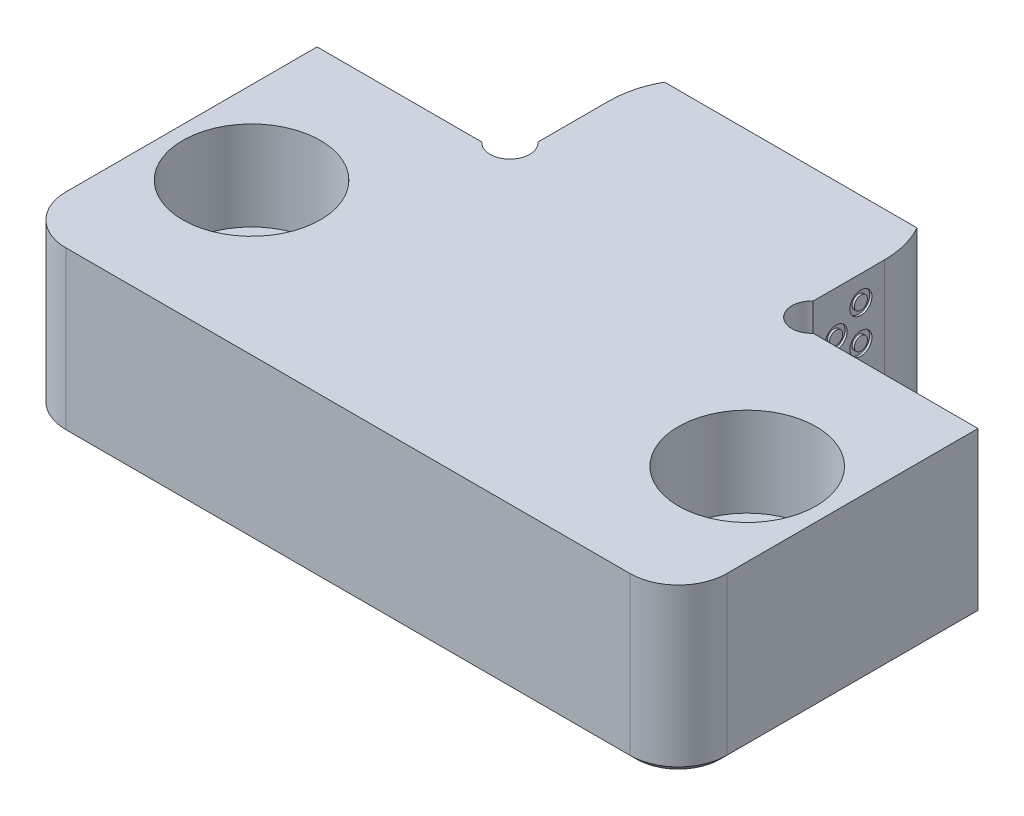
from build123d import *

# Parameters (mm, degrees)
BOSS_EXTRUDE1_DEPTH     = 18.923
SKETCH3_R               = 2.286
CUT_EXTRUDE2_DEPTH      = 55.799433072
CUT_EXTRUDE3_DEPTH      = 86.777665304
FILLET1_R               = 5.588
CHAMFER3_SIZE           = 0.762
F_3_8_CBORE_D           = 10.31748
F_3_8_CBORE_CBORE_D     = 15.875
F_3_8_CBORE_CBORE_DEPTH = 10.287
SKETCH8_R               = 1.27
SKETCH8_R_2             = 0.762
CUT_EXTRUDE4_DEPTH      = 0.254


with BuildPart() as part:
    # Sketch1 → Boss-Extrude1 (new body)
    with BuildSketch(Plane(origin=(0, 0, 0), x_dir=(1, 0, 0), z_dir=(0, 1, 0))):
        with BuildLine():
            Line((-38.1, -34.544), (38.1, -34.544))
            Line((38.1, -34.544), (38.1, 0))
            Line((38.1, 0), (15.87246, 0))
            Line((15.87246, 0), (15.87246, 11.43))
            ThreePointArc((15.87246, 11.43), (15.539429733, 14.053218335), (14.561468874, 16.51))
            Line((14.561468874, 16.51), (-14.561468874, 16.51))
            ThreePointArc((-14.561468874, 16.51), (-15.539429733, 14.053218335), (-15.87246, 11.43))
            Line((-15.87246, 11.43), (-15.87246, 0))
            Line((-15.87246, 0), (-38.1, 0))
            Line((-38.1, 0), (-38.1, -34.544))
        make_face()
    extrude(amount=-BOSS_EXTRUDE1_DEPTH)

    # Sketch3 → Cut-Extrude2 (cut, through all)
    with BuildSketch(Plane(origin=(0, 0, 0), x_dir=(1, 0, 0), z_dir=(0, 1, 0))):
        with Locations((17.39646, 1.524)):
            Circle(SKETCH3_R)
        with Locations((-17.39646, 1.524)):
            Circle(SKETCH3_R)
    extrude(amount=-CUT_EXTRUDE2_DEPTH, mode=Mode.SUBTRACT)

    # Sketch5 → Cut-Extrude3 (cut, through all)
    with BuildSketch(Plane(origin=(38.1, 0, 0), x_dir=(0, 0, -1), z_dir=(1, 0, 0))):
        with BuildLine():
            Line((0, -18.669), (0, -45.48001446))
            Line((0, -45.48001446), (50.8, -45.48001446))
            Line((50.8, -45.48001446), (50.8, -7.38001446))
            ThreePointArc((50.8, -7.38001446), (26.670108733, -15.811022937), (1.27, -18.669))
            Line((1.27, -18.669), (0, -18.669))
        make_face()
    extrude(amount=-CUT_EXTRUDE3_DEPTH, mode=Mode.SUBTRACT)

    # Fillet1
    fillet1_edges = [part.edges().sort_by_distance(p)[0] for p in [
        (38.1, -9.4615, 34.544),
        (-38.1, -9.4615, 34.544),
    ]]
    fillet(fillet1_edges, radius=FILLET1_R)

    # Chamfer3
    chamfer3_edges = [part.edges().sort_by_distance(p)[0] for p in [
        (-38.1, -18.923, 14.478),
        (0, -18.923, 34.544),
        (38.1, -18.923, 14.478),
        (36.463312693, -18.923, 32.907312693),
        (-36.463312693, -18.923, 32.907312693),
    ]]
    chamfer(chamfer3_edges, length=CHAMFER3_SIZE)

    # 3_8_ CBORE (through all)
    with Locations(Plane(origin=(0, 0, 0), x_dir=(-1, 0, 0), z_dir=(0, 1, 0))):
        with Locations((28.575, 17.0815), (-28.575, 17.0815)):
            CounterBoreHole(F_3_8_CBORE_D / 2, F_3_8_CBORE_CBORE_D / 2, F_3_8_CBORE_CBORE_DEPTH)

    # Sketch8 → Cut-Extrude4 (cut)
    # profile 1 of 7: a face of its own
    with BuildSketch(Plane(origin=(15.87246, 0, 0), x_dir=(0, 0, -1), z_dir=(1, 0, 0))):
        with Locations((8.728568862, -2.916741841)):
            Circle(SKETCH8_R)
        with Locations((8.728568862, -2.916741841)):
            Circle(SKETCH8_R_2, mode=Mode.SUBTRACT)
    # profile 2 of 7: a face of its own
    with BuildSketch(Plane(origin=(15.87246, 0, 0), x_dir=(0, 0, -1), z_dir=(1, 0, 0))):
        with Locations((8.728568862, -15.453512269)):
            Circle(SKETCH8_R)
        with Locations((8.728568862, -15.453512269)):
            Circle(SKETCH8_R_2, mode=Mode.SUBTRACT)
    # profile 3 of 7: a face of its own
    with BuildSketch(Plane(origin=(15.87246, 0, 0), x_dir=(0, 0, -1), z_dir=(1, 0, 0))):
        with Locations((8.633951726, -11.290358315)):
            Circle(SKETCH8_R)
        with Locations((8.633951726, -11.290358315)):
            Circle(SKETCH8_R_2, mode=Mode.SUBTRACT)
    # profile 4 of 7: a face of its own
    with BuildSketch(Plane(origin=(15.87246, 0, 0), x_dir=(0, 0, -1), z_dir=(1, 0, 0))):
        with Locations((8.728568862, -6.985278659)):
            Circle(SKETCH8_R)
        with Locations((8.728568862, -6.985278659)):
            Circle(SKETCH8_R_2, mode=Mode.SUBTRACT)
    # profile 5 of 7: a face of its own
    with BuildSketch(Plane(origin=(15.87246, 0, 0), x_dir=(0, 0, -1), z_dir=(1, 0, 0))):
        with Locations((5.869330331, -4.991760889)):
            Circle(SKETCH8_R)
        with Locations((5.869330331, -4.991760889)):
            Circle(SKETCH8_R_2, mode=Mode.SUBTRACT)
    # profile 6 of 7: a face of its own
    with BuildSketch(Plane(origin=(15.87246, 0, 0), x_dir=(0, 0, -1), z_dir=(1, 0, 0))):
        with Locations((5.774713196, -13.365377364)):
            Circle(SKETCH8_R)
        with Locations((5.774713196, -13.365377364)):
            Circle(SKETCH8_R_2, mode=Mode.SUBTRACT)
    # profile 7 of 7: a face of its own
    with BuildSketch(Plane(origin=(15.87246, 0, 0), x_dir=(0, 0, -1), z_dir=(1, 0, 0))):
        with Locations((5.869330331, -9.060297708)):
            Circle(SKETCH8_R)
        with Locations((5.869330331, -9.060297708)):
            Circle(SKETCH8_R_2, mode=Mode.SUBTRACT)
    cut_extrude4 = extrude(amount=-CUT_EXTRUDE4_DEPTH, mode=Mode.SUBTRACT)

    # Mirror1: Cut-Extrude4 across plane
    add(cut_extrude4.mirror(Plane(origin=(0, 0, 0), x_dir=(0, 0, 1), z_dir=(1, 0, 0))), mode=Mode.SUBTRACT)


solid = part.part
